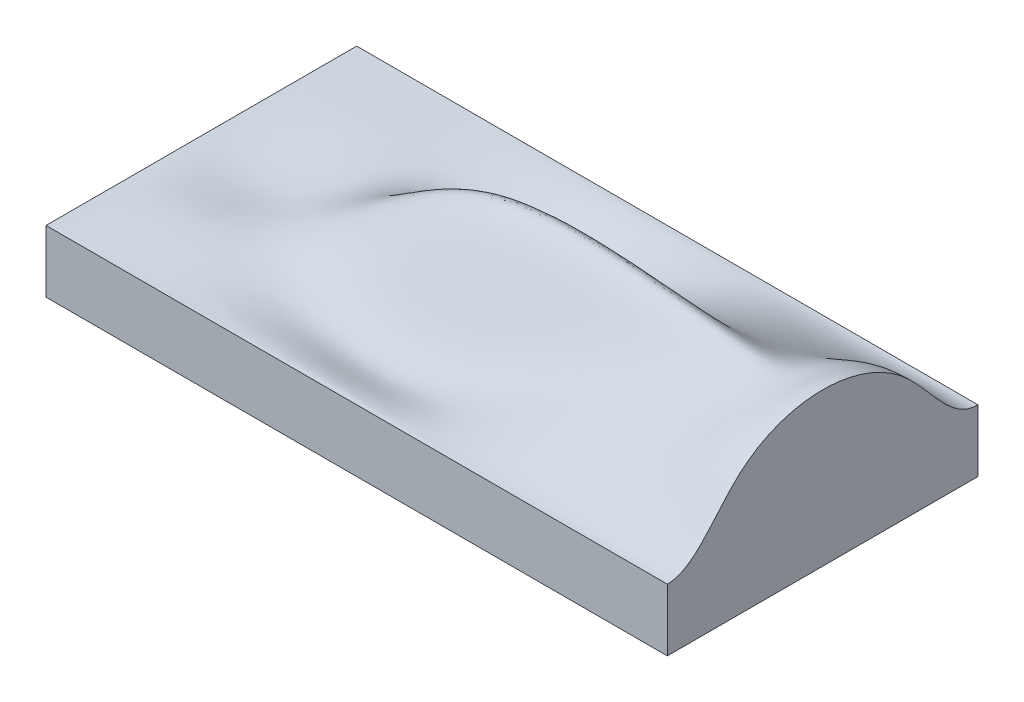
ISO-10303-21;
HEADER;
FILE_DESCRIPTION(('STEP AP214'),'2;1');
FILE_NAME('part.step','',(''),(''),'','','');
FILE_SCHEMA(('AUTOMOTIVE_DESIGN { 1 0 10303 214 1 1 1 1 }'));
ENDSEC;
DATA;
#1=APPLICATION_CONTEXT('core data for automotive mechanical design processes');
#2=APPLICATION_PROTOCOL_DEFINITION('international standard','automotive_design',2000,#1);
#3=PRODUCT_CONTEXT('',#1,'mechanical');
#4=PRODUCT('Part','Part','',(#3));
#5=PRODUCT_RELATED_PRODUCT_CATEGORY('part','',(#4));
#6=PRODUCT_DEFINITION_FORMATION('','',#4);
#7=PRODUCT_DEFINITION_CONTEXT('part definition',#1,'design');
#8=PRODUCT_DEFINITION('design','',#6,#7);
#9=PRODUCT_DEFINITION_SHAPE('','',#8);
#10=(LENGTH_UNIT() NAMED_UNIT(*) SI_UNIT(.MILLI.,.METRE.));
#11=(NAMED_UNIT(*) PLANE_ANGLE_UNIT() SI_UNIT($,.RADIAN.));
#12=(NAMED_UNIT(*) SI_UNIT($,.STERADIAN.) SOLID_ANGLE_UNIT());
#13=UNCERTAINTY_MEASURE_WITH_UNIT(LENGTH_MEASURE(1.E-05),#10,'distance_accuracy_value','');
#14=(GEOMETRIC_REPRESENTATION_CONTEXT(3) GLOBAL_UNCERTAINTY_ASSIGNED_CONTEXT((#13)) GLOBAL_UNIT_ASSIGNED_CONTEXT((#10,
#11,#12)) REPRESENTATION_CONTEXT('',''));
#15=CARTESIAN_POINT('',(0.,0.,0.));
#16=DIRECTION('',(0.,0.,1.));
#17=DIRECTION('',(1.,0.,0.));
#18=AXIS2_PLACEMENT_3D('',#15,#16,#17);
#19=CARTESIAN_POINT('',(127.,25.4,63.5));
#20=DIRECTION('',(-1.,0.,0.));
#21=DIRECTION('',(0.,0.,1.));
#22=AXIS2_PLACEMENT_3D('',#19,#20,#21);
#23=PLANE('',#22);
#24=DIRECTION('',(0.,0.,-1.));
#25=VECTOR('',#24,1.);
#26=CARTESIAN_POINT('',(127.,0.,63.5));
#27=LINE('',#26,#25);
#28=CARTESIAN_POINT('',(127.,0.,63.5));
#29=VERTEX_POINT('',#28);
#30=CARTESIAN_POINT('',(127.,0.,-63.5));
#31=VERTEX_POINT('',#30);
#32=EDGE_CURVE('E129',#29,#31,#27,.T.);
#33=ORIENTED_EDGE('',*,*,#32,.T.);
#34=DIRECTION('',(0.,-1.,0.));
#35=VECTOR('',#34,1.);
#36=CARTESIAN_POINT('',(127.,25.4,-63.5));
#37=LINE('',#36,#35);
#38=CARTESIAN_POINT('',(127.,25.4,-63.5));
#39=VERTEX_POINT('',#38);
#40=EDGE_CURVE('E13',#39,#31,#37,.T.);
#41=ORIENTED_EDGE('',*,*,#40,.F.);
#42=CARTESIAN_POINT('',(127.,25.4,63.5));
#43=CARTESIAN_POINT('',(127.,25.399972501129,63.2735251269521));
#44=CARTESIAN_POINT('',(127.,25.4058899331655,63.047049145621));
#45=CARTESIAN_POINT('',(127.,25.4295775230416,62.5948776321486));
#46=CARTESIAN_POINT('',(127.,25.4473393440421,62.3691816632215));
#47=CARTESIAN_POINT('',(127.,25.4946720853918,61.919094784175));
#48=CARTESIAN_POINT('',(127.,25.5242397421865,61.6947035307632));
#49=CARTESIAN_POINT('',(127.,25.5944910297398,61.2507316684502));
#50=CARTESIAN_POINT('',(127.,25.635021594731,61.0311267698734));
#51=CARTESIAN_POINT('',(127.,25.7270346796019,60.5941898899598));
#52=CARTESIAN_POINT('',(127.,25.7785189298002,60.3768582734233));
#53=CARTESIAN_POINT('',(127.,25.891984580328,59.9449383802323));
#54=CARTESIAN_POINT('',(127.,25.9539672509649,59.7303504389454));
#55=CARTESIAN_POINT('',(127.,26.1173998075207,59.2104394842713));
#56=CARTESIAN_POINT('',(127.,26.2242073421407,58.9067897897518));
#57=CARTESIAN_POINT('',(127.,26.4566946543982,58.3067042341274));
#58=CARTESIAN_POINT('',(127.,26.5823827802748,58.0102716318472));
#59=CARTESIAN_POINT('',(127.,26.8506623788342,57.4251236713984));
#60=CARTESIAN_POINT('',(127.,26.9932568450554,57.1364096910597));
#61=CARTESIAN_POINT('',(127.,27.2942219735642,56.5652930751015));
#62=CARTESIAN_POINT('',(127.,27.4526764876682,56.2829348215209));
#63=CARTESIAN_POINT('',(127.,27.782757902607,55.7261814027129));
#64=CARTESIAN_POINT('',(127.,27.9543804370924,55.4517836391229));
#65=CARTESIAN_POINT('',(127.,28.309021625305,54.9107093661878));
#66=CARTESIAN_POINT('',(127.,28.4920337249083,54.6440285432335));
#67=CARTESIAN_POINT('',(127.,28.9274183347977,54.0346315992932));
#68=CARTESIAN_POINT('',(127.,29.1834330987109,53.6945195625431));
#69=CARTESIAN_POINT('',(127.,29.7096846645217,53.0254345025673));
#70=CARTESIAN_POINT('',(127.,29.9799245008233,52.6964638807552));
#71=CARTESIAN_POINT('',(127.,30.5324386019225,52.0480166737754));
#72=CARTESIAN_POINT('',(127.,30.8147294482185,51.7285542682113));
#73=CARTESIAN_POINT('',(127.,31.38883998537,51.0983793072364));
#74=CARTESIAN_POINT('',(127.,31.6806590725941,50.7876661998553));
#75=CARTESIAN_POINT('',(127.,32.2731480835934,50.1726367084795));
#76=CARTESIAN_POINT('',(127.,32.5738463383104,49.8683477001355));
#77=CARTESIAN_POINT('',(127.,33.1815773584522,49.2661721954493));
#78=CARTESIAN_POINT('',(127.,33.4886102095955,48.9682857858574));
#79=CARTESIAN_POINT('',(127.,34.1085532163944,48.3770498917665));
#80=CARTESIAN_POINT('',(127.,34.4214767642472,48.0837144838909));
#81=CARTESIAN_POINT('',(127.,35.051323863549,47.5013640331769));
#82=CARTESIAN_POINT('',(127.,35.3682475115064,47.212349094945));
#83=CARTESIAN_POINT('',(127.,36.3236798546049,46.350227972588));
#84=CARTESIAN_POINT('',(127.,36.966726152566,45.782162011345));
#85=CARTESIAN_POINT('',(127.,38.2645719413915,44.6472145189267));
#86=CARTESIAN_POINT('',(127.,38.9194250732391,44.0803949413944));
#87=CARTESIAN_POINT('',(127.,40.2277360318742,42.9484803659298));
#88=CARTESIAN_POINT('',(127.,40.8811932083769,42.3833846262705));
#89=CARTESIAN_POINT('',(127.,42.1821140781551,41.2487536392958));
#90=CARTESIAN_POINT('',(127.,42.829586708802,40.6792286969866));
#91=CARTESIAN_POINT('',(127.,44.1141664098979,39.5298233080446));
#92=CARTESIAN_POINT('',(127.,44.7512831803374,38.9499537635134));
#93=CARTESIAN_POINT('',(127.,46.0107347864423,37.7738804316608));
#94=CARTESIAN_POINT('',(127.,46.6330648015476,37.1776714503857));
#95=CARTESIAN_POINT('',(127.,47.7542748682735,36.0656675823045));
#96=CARTESIAN_POINT('',(127.,48.2563707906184,35.5531331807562));
#97=CARTESIAN_POINT('',(127.,48.9957918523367,34.7710349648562));
#98=CARTESIAN_POINT('',(127.,49.240061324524,34.5080252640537));
#99=CARTESIAN_POINT('',(127.,49.7234210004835,33.9772798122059));
#100=CARTESIAN_POINT('',(127.,49.962511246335,33.7095440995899));
#101=CARTESIAN_POINT('',(127.,50.3168255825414,33.3041598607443));
#102=CARTESIAN_POINT('',(127.,50.4342131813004,33.168398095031));
#103=CARTESIAN_POINT('',(127.,50.6674647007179,32.8955720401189));
#104=CARTESIAN_POINT('',(127.,50.7833286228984,32.7585077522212));
#105=CARTESIAN_POINT('',(127.,51.1285997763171,32.3453747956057));
#106=CARTESIAN_POINT('',(127.,51.355688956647,32.0673631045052));
#107=CARTESIAN_POINT('',(127.,51.8035722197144,31.5063336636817));
#108=CARTESIAN_POINT('',(127.,52.0243665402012,31.2233161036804));
#109=CARTESIAN_POINT('',(127.,52.4595685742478,30.6524189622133));
#110=CARTESIAN_POINT('',(127.,52.6739762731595,30.3645393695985));
#111=CARTESIAN_POINT('',(127.,53.3063341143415,29.4954163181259));
#112=CARTESIAN_POINT('',(127.,53.7146646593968,28.9071276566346));
#113=CARTESIAN_POINT('',(127.,54.5050384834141,27.7128907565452));
#114=CARTESIAN_POINT('',(127.,54.8870725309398,27.1069364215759));
#115=CARTESIAN_POINT('',(127.,55.6242446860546,25.8787095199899));
#116=CARTESIAN_POINT('',(127.,55.9793774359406,25.2564337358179));
#117=CARTESIAN_POINT('',(127.,56.6621919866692,23.9970196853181));
#118=CARTESIAN_POINT('',(127.,56.9898736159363,23.3598813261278));
#119=CARTESIAN_POINT('',(127.,57.7225355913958,21.8563097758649));
#120=CARTESIAN_POINT('',(127.,58.1166454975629,20.9845537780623));
#121=CARTESIAN_POINT('',(127.,58.8544822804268,19.2202273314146));
#122=CARTESIAN_POINT('',(127.,59.1982192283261,18.3276610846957));
#123=CARTESIAN_POINT('',(127.,59.8349040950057,16.5246517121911));
#124=CARTESIAN_POINT('',(127.,60.1278547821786,15.6142095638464));
#125=CARTESIAN_POINT('',(127.,60.6630536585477,13.7770163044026));
#126=CARTESIAN_POINT('',(127.,60.9052219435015,12.8502419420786));
#127=CARTESIAN_POINT('',(127.,61.3380639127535,10.9846698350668));
#128=CARTESIAN_POINT('',(127.,61.5287339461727,10.0458712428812));
#129=CARTESIAN_POINT('',(127.,61.8584107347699,8.15928099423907));
#130=CARTESIAN_POINT('',(127.,61.9974160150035,7.21148908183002));
#131=CARTESIAN_POINT('',(127.,62.2810394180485,4.82745599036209));
#132=CARTESIAN_POINT('',(127.,62.3927790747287,3.38717558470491));
#133=CARTESIAN_POINT('',(127.,62.4985399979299,0.502467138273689));
#134=CARTESIAN_POINT('',(127.,62.492563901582,-0.941960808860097));
#135=CARTESIAN_POINT('',(127.,62.3629280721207,-3.82566767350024));
#136=CARTESIAN_POINT('',(127.,62.2392603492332,-5.26494623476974));
#137=CARTESIAN_POINT('',(127.,61.8743571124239,-8.12855386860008));
#138=CARTESIAN_POINT('',(127.,61.6331207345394,-9.55288283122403));
#139=CARTESIAN_POINT('',(127.,61.0238442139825,-12.4219704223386));
#140=CARTESIAN_POINT('',(127.,60.6519856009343,-13.8659193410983));
#141=CARTESIAN_POINT('',(127.,59.7841183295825,-16.7164936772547));
#142=CARTESIAN_POINT('',(127.,59.2880952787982,-18.1231147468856));
#143=CARTESIAN_POINT('',(127.,58.4528582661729,-20.1945844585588));
#144=CARTESIAN_POINT('',(127.,58.1594678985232,-20.8782280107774));
#145=CARTESIAN_POINT('',(127.,57.5424999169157,-22.2317296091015));
#146=CARTESIAN_POINT('',(127.,57.218925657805,-22.9015891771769));
#147=CARTESIAN_POINT('',(127.,56.5420671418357,-24.2258406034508));
#148=CARTESIAN_POINT('',(127.,56.188792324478,-24.8802372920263));
#149=CARTESIAN_POINT('',(127.,55.4529420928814,-26.1722473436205));
#150=CARTESIAN_POINT('',(127.,55.0703711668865,-26.8098632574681));
#151=CARTESIAN_POINT('',(127.,54.4241131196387,-27.8331391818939));
#152=CARTESIAN_POINT('',(127.,54.1691212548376,-28.2243200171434));
#153=CARTESIAN_POINT('',(127.,53.648003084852,-28.9990818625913));
#154=CARTESIAN_POINT('',(127.,53.3818792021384,-29.3826644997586));
#155=CARTESIAN_POINT('',(127.,52.8386498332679,-30.1419229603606));
#156=CARTESIAN_POINT('',(127.,52.5615452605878,-30.5175994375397));
#157=CARTESIAN_POINT('',(127.,51.9970504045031,-31.2600657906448));
#158=CARTESIAN_POINT('',(127.,51.7096797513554,-31.6268705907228));
#159=CARTESIAN_POINT('',(127.,51.1243516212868,-32.3519641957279));
#160=CARTESIAN_POINT('',(127.,50.8263936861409,-32.7102526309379));
#161=CARTESIAN_POINT('',(127.,50.2202545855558,-33.4180254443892));
#162=CARTESIAN_POINT('',(127.,49.9120739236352,-33.7675102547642));
#163=CARTESIAN_POINT('',(127.,48.9757070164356,-34.8022840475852));
#164=CARTESIAN_POINT('',(127.,48.3342891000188,-35.4756169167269));
#165=CARTESIAN_POINT('',(127.,47.0250117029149,-36.7964503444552));
#166=CARTESIAN_POINT('',(127.,46.3571391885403,-37.4439378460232));
#167=CARTESIAN_POINT('',(127.,45.0026952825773,-38.719335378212));
#168=CARTESIAN_POINT('',(127.,44.3161185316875,-39.347239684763));
#169=CARTESIAN_POINT('',(127.,42.9277234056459,-40.5929400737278));
#170=CARTESIAN_POINT('',(127.,42.2258459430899,-41.2106698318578));
#171=CARTESIAN_POINT('',(127.,40.8168022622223,-42.4394859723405));
#172=CARTESIAN_POINT('',(127.,40.1096381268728,-43.0505747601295));
#173=CARTESIAN_POINT('',(127.,38.6962336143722,-44.2735964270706));
#174=CARTESIAN_POINT('',(127.,37.9899931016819,-44.8855291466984));
#175=CARTESIAN_POINT('',(127.,36.9017242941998,-45.8408049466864));
#176=CARTESIAN_POINT('',(127.,36.5169332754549,-46.1809891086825));
#177=CARTESIAN_POINT('',(127.,35.7510855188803,-46.8656142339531));
#178=CARTESIAN_POINT('',(127.,35.3700291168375,-47.2100555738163));
#179=CARTESIAN_POINT('',(127.,34.6131346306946,-47.9048567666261));
#180=CARTESIAN_POINT('',(127.,34.2372980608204,-48.2552182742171));
#181=CARTESIAN_POINT('',(127.,33.4925333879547,-48.9637493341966));
#182=CARTESIAN_POINT('',(127.,33.1236102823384,-49.3219241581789));
#183=CARTESIAN_POINT('',(127.,32.3966369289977,-50.0462639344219));
#184=CARTESIAN_POINT('',(127.,32.0385486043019,-50.4123905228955));
#185=CARTESIAN_POINT('',(127.,31.3344076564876,-51.1560105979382));
#186=CARTESIAN_POINT('',(127.,30.9883535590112,-51.5335026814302));
#187=CARTESIAN_POINT('',(127.,30.3118565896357,-52.3016937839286));
#188=CARTESIAN_POINT('',(127.,29.9814002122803,-52.6923808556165));
#189=CARTESIAN_POINT('',(127.,29.3400705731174,-53.4892410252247));
#190=CARTESIAN_POINT('',(127.,29.0291847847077,-53.8954039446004));
#191=CARTESIAN_POINT('',(127.,28.5552178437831,-54.5541054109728));
#192=CARTESIAN_POINT('',(127.,28.3840897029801,-54.8008640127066));
#193=CARTESIAN_POINT('',(127.,28.0515019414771,-55.300858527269));
#194=CARTESIAN_POINT('',(127.,27.8900428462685,-55.5540947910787));
#195=CARTESIAN_POINT('',(127.,27.5781323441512,-56.0673217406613));
#196=CARTESIAN_POINT('',(127.,27.4276823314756,-56.3273132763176));
#197=CARTESIAN_POINT('',(127.,27.1399333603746,-56.8529701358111));
#198=CARTESIAN_POINT('',(127.,27.0025779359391,-57.1186044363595));
#199=CARTESIAN_POINT('',(127.,26.7417984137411,-57.6566321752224));
#200=CARTESIAN_POINT('',(127.,26.6183736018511,-57.9290252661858));
#201=CARTESIAN_POINT('',(127.,26.3870432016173,-58.4803012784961));
#202=CARTESIAN_POINT('',(127.,26.2791348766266,-58.7591830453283));
#203=CARTESIAN_POINT('',(127.,26.0963084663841,-59.2777098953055));
#204=CARTESIAN_POINT('',(127.,26.0188751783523,-59.5164688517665));
#205=CARTESIAN_POINT('',(127.,25.8768493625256,-59.997771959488));
#206=CARTESIAN_POINT('',(127.,25.8122558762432,-60.240315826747));
#207=CARTESIAN_POINT('',(127.,25.6966369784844,-60.7285718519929));
#208=CARTESIAN_POINT('',(127.,25.6456088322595,-60.9742833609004));
#209=CARTESIAN_POINT('',(127.,25.557040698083,-61.4716785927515));
#210=CARTESIAN_POINT('',(127.,25.5196992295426,-61.7233977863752));
#211=CARTESIAN_POINT('',(127.,25.4598879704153,-62.2286935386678));
#212=CARTESIAN_POINT('',(127.,25.4374237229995,-62.4822707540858));
#213=CARTESIAN_POINT('',(127.,25.4074501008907,-62.990564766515));
#214=CARTESIAN_POINT('',(127.,25.3999558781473,-63.2452824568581));
#215=CARTESIAN_POINT('',(127.,25.4,-63.5));
#216=B_SPLINE_CURVE_WITH_KNOTS('',3,(#42,#43,#44,#45,#46,#47,#48,#49,#50,#51,#52,#53,#54,#55,
#56,#57,#58,#59,#60,#61,#62,#63,#64,#65,#66,#67,#68,#69,#70,#71,#72,#73,#74,#75,#76,#77,#78,#79,
#80,#81,#82,#83,#84,#85,#86,#87,#88,#89,#90,#91,#92,#93,#94,#95,#96,#97,#98,#99,#100,#101,#102,
#103,#104,#105,#106,#107,#108,#109,#110,#111,#112,#113,#114,#115,#116,#117,#118,#119,#120,#121,
#122,#123,#124,#125,#126,#127,#128,#129,#130,#131,#132,#133,#134,#135,#136,#137,#138,#139,#140,
#141,#142,#143,#144,#145,#146,#147,#148,#149,#150,#151,#152,#153,#154,#155,#156,#157,#158,#159,
#160,#161,#162,#163,#164,#165,#166,#167,#168,#169,#170,#171,#172,#173,#174,#175,#176,#177,#178,
#179,#180,#181,#182,#183,#184,#185,#186,#187,#188,#189,#190,#191,#192,#193,#194,#195,#196,#197,
#198,#199,#200,#201,#202,#203,#204,#205,#206,#207,#208,#209,#210,#211,#212,#213,#214,#215),
.UNSPECIFIED.,.F.,.F.,(4,2,2,2,2,2,2,2,2,2,2,2,2,2,2,2,2,2,2,2,2,2,2,2,2,2,2,2,2,2,2,2,2,2,2,2,
2,2,2,2,2,2,2,2,2,2,2,2,2,2,2,2,2,2,2,2,2,2,2,2,2,2,2,2,2,2,2,2,2,2,2,2,2,2,2,2,2,2,2,2,2,2,2,2,
2,2,4),(0.,0.679347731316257,1.35821779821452,2.03690033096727,2.70655677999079,
3.37631909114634,4.04616250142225,5.01109523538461,5.97645588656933,6.94198772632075,
7.91292497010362,8.88354164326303,9.85360484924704,11.1302243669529,12.4071173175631,
13.6858277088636,14.9644572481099,16.2477372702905,17.5310346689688,18.8177248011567,
20.1044460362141,22.6783984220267,25.2766813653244,27.8684059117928,30.455273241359,
33.0395588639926,35.6246757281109,37.776732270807,38.8535130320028,39.9302850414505,
40.4686990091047,41.0071124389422,42.0839276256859,43.1607020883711,44.2374790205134,
46.3850471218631,48.5333653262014,50.6821102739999,52.8308686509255,55.6993317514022,
58.567220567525,61.4349530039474,64.3071644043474,67.1795793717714,70.0520763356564,
74.3807808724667,78.7093884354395,83.0382898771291,87.3672231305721,91.834984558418,
96.3032641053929,98.5344774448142,100.765443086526,102.995702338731,105.225620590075,
106.626300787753,108.026677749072,109.426938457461,110.824651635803,112.222425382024,
113.620130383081,116.408872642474,119.199006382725,121.989948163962,124.794859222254,
127.598717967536,130.402104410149,131.942895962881,133.483824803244,135.025191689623,
136.567632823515,138.103808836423,139.63979597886,141.174427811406,142.7080671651,
143.608752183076,144.509486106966,145.410333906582,146.30710246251,147.203825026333,
148.100389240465,148.853062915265,149.605680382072,150.358146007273,151.121130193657,
151.884398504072,152.648438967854),.UNSPECIFIED.);
#217=CARTESIAN_POINT('',(127.,25.4,63.5));
#218=VERTEX_POINT('',#217);
#219=EDGE_CURVE('E139',#218,#39,#216,.T.);
#220=ORIENTED_EDGE('',*,*,#219,.F.);
#221=DIRECTION('',(0.,-1.,0.));
#222=VECTOR('',#221,1.);
#223=CARTESIAN_POINT('',(127.,25.4,63.5));
#224=LINE('',#223,#222);
#225=EDGE_CURVE('E135',#218,#29,#224,.T.);
#226=ORIENTED_EDGE('',*,*,#225,.T.);
#227=EDGE_LOOP('',(#33,#41,#220,#226));
#228=FACE_BOUND('',#227,.T.);
#229=ADVANCED_FACE('F68',(#228),#23,.F.);
#230=CARTESIAN_POINT('',(-127.,25.4,-63.5));
#231=DIRECTION('',(0.,0.,1.));
#232=DIRECTION('',(1.,0.,0.));
#233=AXIS2_PLACEMENT_3D('',#230,#231,#232);
#234=PLANE('',#233);
#235=DIRECTION('',(-1.,0.,0.));
#236=VECTOR('',#235,1.);
#237=CARTESIAN_POINT('',(-127.,0.,-63.5));
#238=LINE('',#237,#236);
#239=CARTESIAN_POINT('',(-127.,0.,-63.5));
#240=VERTEX_POINT('',#239);
#241=EDGE_CURVE('E126',#31,#240,#238,.T.);
#242=ORIENTED_EDGE('',*,*,#241,.T.);
#243=DIRECTION('',(0.,-1.,0.));
#244=VECTOR('',#243,1.);
#245=CARTESIAN_POINT('',(-127.,25.4,-63.5));
#246=LINE('',#245,#244);
#247=CARTESIAN_POINT('',(-127.,25.4,-63.5));
#248=VERTEX_POINT('',#247);
#249=EDGE_CURVE('E81',#248,#240,#246,.T.);
#250=ORIENTED_EDGE('',*,*,#249,.F.);
#251=DIRECTION('',(-1.,0.,0.));
#252=VECTOR('',#251,1.);
#253=CARTESIAN_POINT('',(-127.,25.4,-63.5));
#254=LINE('',#253,#252);
#255=EDGE_CURVE('E100',#39,#248,#254,.T.);
#256=ORIENTED_EDGE('',*,*,#255,.F.);
#257=ORIENTED_EDGE('',*,*,#40,.T.);
#258=EDGE_LOOP('',(#242,#250,#256,#257));
#259=FACE_BOUND('',#258,.T.);
#260=ADVANCED_FACE('F132',(#259),#234,.F.);
#261=CARTESIAN_POINT('',(-127.,25.4,63.5));
#262=DIRECTION('',(1.,0.,0.));
#263=DIRECTION('',(0.,0.,-1.));
#264=AXIS2_PLACEMENT_3D('',#261,#262,#263);
#265=PLANE('',#264);
#266=DIRECTION('',(0.,0.,1.));
#267=VECTOR('',#266,1.);
#268=CARTESIAN_POINT('',(-127.,0.,63.5));
#269=LINE('',#268,#267);
#270=CARTESIAN_POINT('',(-127.,0.,63.5));
#271=VERTEX_POINT('',#270);
#272=EDGE_CURVE('E118',#240,#271,#269,.T.);
#273=ORIENTED_EDGE('',*,*,#272,.T.);
#274=DIRECTION('',(0.,-1.,0.));
#275=VECTOR('',#274,1.);
#276=CARTESIAN_POINT('',(-127.,25.4,63.5));
#277=LINE('',#276,#275);
#278=CARTESIAN_POINT('',(-127.,25.4,63.5));
#279=VERTEX_POINT('',#278);
#280=EDGE_CURVE('E175',#279,#271,#277,.T.);
#281=ORIENTED_EDGE('',*,*,#280,.F.);
#282=DIRECTION('',(0.,0.,1.));
#283=VECTOR('',#282,1.);
#284=CARTESIAN_POINT('',(-127.,25.4,63.5));
#285=LINE('',#284,#283);
#286=EDGE_CURVE('E179',#248,#279,#285,.T.);
#287=ORIENTED_EDGE('',*,*,#286,.F.);
#288=ORIENTED_EDGE('',*,*,#249,.T.);
#289=EDGE_LOOP('',(#273,#281,#287,#288));
#290=FACE_BOUND('',#289,.T.);
#291=ADVANCED_FACE('F162',(#290),#265,.F.);
#292=CARTESIAN_POINT('',(-127.,25.4,63.5));
#293=DIRECTION('',(0.,0.,-1.));
#294=DIRECTION('',(-1.,0.,0.));
#295=AXIS2_PLACEMENT_3D('',#292,#293,#294);
#296=PLANE('',#295);
#297=DIRECTION('',(1.,0.,0.));
#298=VECTOR('',#297,1.);
#299=CARTESIAN_POINT('',(-127.,0.,63.5));
#300=LINE('',#299,#298);
#301=EDGE_CURVE('E110',#271,#29,#300,.T.);
#302=ORIENTED_EDGE('',*,*,#301,.T.);
#303=ORIENTED_EDGE('',*,*,#225,.F.);
#304=DIRECTION('',(1.,0.,0.));
#305=VECTOR('',#304,1.);
#306=CARTESIAN_POINT('',(-127.,25.4,63.5));
#307=LINE('',#306,#305);
#308=EDGE_CURVE('E90',#279,#218,#307,.T.);
#309=ORIENTED_EDGE('',*,*,#308,.F.);
#310=ORIENTED_EDGE('',*,*,#280,.T.);
#311=EDGE_LOOP('',(#302,#303,#309,#310));
#312=FACE_BOUND('',#311,.T.);
#313=ADVANCED_FACE('F220',(#312),#296,.F.);
#314=CARTESIAN_POINT('',(-127.,25.4,63.5));
#315=CARTESIAN_POINT('',(-111.121460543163,25.4,63.5));
#316=CARTESIAN_POINT('',(-83.0293436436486,25.4,63.5));
#317=CARTESIAN_POINT('',(-42.9608228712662,25.4,63.5));
#318=CARTESIAN_POINT('',(6.68031984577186,25.4,63.5));
#319=CARTESIAN_POINT('',(44.1694861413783,25.4,63.5));
#320=CARTESIAN_POINT('',(78.1304184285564,25.4,63.5));
#321=CARTESIAN_POINT('',(94.0862388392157,25.4,63.5));
#322=CARTESIAN_POINT('',(113.171622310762,25.4,63.5));
#323=CARTESIAN_POINT('',(123.808835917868,25.4,63.5));
#324=CARTESIAN_POINT('',(127.,25.4,63.5));
#325=CARTESIAN_POINT('',(-127.,25.4,51.8601774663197));
#326=CARTESIAN_POINT('',(-111.06271922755,25.4788549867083,51.8157853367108));
#327=CARTESIAN_POINT('',(-83.3253140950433,25.158721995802,52.1199550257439));
#328=CARTESIAN_POINT('',(-42.2347880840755,25.9657367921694,51.2168789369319));
#329=CARTESIAN_POINT('',(6.53303512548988,24.9435395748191,51.9116116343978));
#330=CARTESIAN_POINT('',(42.4844832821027,25.9225382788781,53.7778942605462));
#331=CARTESIAN_POINT('',(78.699244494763,25.2236033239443,51.2127920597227));
#332=CARTESIAN_POINT('',(93.2666943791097,24.8950717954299,52.6172609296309));
#333=CARTESIAN_POINT('',(110.361800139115,24.7939643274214,54.7161987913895));
#334=CARTESIAN_POINT('',(123.808835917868,25.4,51.8601774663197));
#335=CARTESIAN_POINT('',(127.,25.4,51.8601774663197));
#336=CARTESIAN_POINT('',(-127.,25.4,30.693510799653));
#337=CARTESIAN_POINT('',(-110.985270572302,27.5940950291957,30.5860442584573));
#338=CARTESIAN_POINT('',(-82.5480757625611,30.7638189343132,30.2230032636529));
#339=CARTESIAN_POINT('',(-44.3369387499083,9.49227272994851,32.017189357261));
#340=CARTESIAN_POINT('',(4.40291480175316,-9.81665693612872,32.6410670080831));
#341=CARTESIAN_POINT('',(61.0966153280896,41.9213147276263,15.7171091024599));
#342=CARTESIAN_POINT('',(99.3104816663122,55.9261476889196,12.722867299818));
#343=CARTESIAN_POINT('',(108.222064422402,57.9481452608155,21.1634247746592));
#344=CARTESIAN_POINT('',(115.61998809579,55.901428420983,34.6375655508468));
#345=CARTESIAN_POINT('',(123.808835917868,53.6979862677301,38.1119659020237));
#346=CARTESIAN_POINT('',(127.,53.6979862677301,38.1119659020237));
#347=CARTESIAN_POINT('',(-127.,25.4,0.));
#348=CARTESIAN_POINT('',(-110.950411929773,19.9502026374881,0.));
#349=CARTESIAN_POINT('',(-82.1982507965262,13.0421205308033,0.));
#350=CARTESIAN_POINT('',(-45.283089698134,62.3834611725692,0.));
#351=CARTESIAN_POINT('',(3.44417507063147,112.11869981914,0.));
#352=CARTESIAN_POINT('',(69.4736963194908,74.1765076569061,-1.43613936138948E-13));
#353=CARTESIAN_POINT('',(108.587334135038,61.2863601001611,0.));
#354=CARTESIAN_POINT('',(114.953283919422,59.3026626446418,0.));
#355=CARTESIAN_POINT('',(117.986630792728,61.6473376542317,0.));
#356=CARTESIAN_POINT('',(123.808835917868,66.4345455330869,0.));
#357=CARTESIAN_POINT('',(127.,66.4345455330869,0.));
#358=CARTESIAN_POINT('',(-127.,25.4,-30.693510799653));
#359=CARTESIAN_POINT('',(-110.985270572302,27.5940950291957,-30.5860442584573));
#360=CARTESIAN_POINT('',(-82.5480757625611,30.7638189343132,-30.2230032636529));
#361=CARTESIAN_POINT('',(-44.3369387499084,9.49227272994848,-32.017189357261));
#362=CARTESIAN_POINT('',(4.40291480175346,-9.81665693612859,-32.6410670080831));
#363=CARTESIAN_POINT('',(61.0966153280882,41.9213147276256,-15.7171091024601));
#364=CARTESIAN_POINT('',(99.3104816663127,55.9261476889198,-12.722867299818));
#365=CARTESIAN_POINT('',(108.222064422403,57.9481452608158,-21.1634247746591));
#366=CARTESIAN_POINT('',(115.61998809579,55.901428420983,-34.6375655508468));
#367=CARTESIAN_POINT('',(123.808835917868,53.6979862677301,-38.1119659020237));
#368=CARTESIAN_POINT('',(127.,53.6979862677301,-38.1119659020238));
#369=CARTESIAN_POINT('',(-127.,25.4,-51.8601774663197));
#370=CARTESIAN_POINT('',(-111.06271922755,25.4788549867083,-51.8157853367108));
#371=CARTESIAN_POINT('',(-83.3253140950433,25.158721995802,-52.1199550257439));
#372=CARTESIAN_POINT('',(-42.2347880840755,25.9657367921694,-51.2168789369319));
#373=CARTESIAN_POINT('',(6.53303512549,24.9435395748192,-51.9116116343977));
#374=CARTESIAN_POINT('',(42.4844832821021,25.9225382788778,-53.7778942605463));
#375=CARTESIAN_POINT('',(78.6992444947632,25.2236033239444,-51.2127920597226));
#376=CARTESIAN_POINT('',(93.26669437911,24.89507179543,-52.6172609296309));
#377=CARTESIAN_POINT('',(110.361800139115,24.7939643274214,-54.7161987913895));
#378=CARTESIAN_POINT('',(123.808835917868,25.4,-51.8601774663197));
#379=CARTESIAN_POINT('',(127.,25.4,-51.8601774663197));
#380=CARTESIAN_POINT('',(-127.,25.4,-63.5));
#381=CARTESIAN_POINT('',(-111.121460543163,25.4,-63.5));
#382=CARTESIAN_POINT('',(-83.0293436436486,25.4,-63.5));
#383=CARTESIAN_POINT('',(-42.9608228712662,25.4,-63.5));
#384=CARTESIAN_POINT('',(6.68031984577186,25.4,-63.5));
#385=CARTESIAN_POINT('',(44.1694861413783,25.4,-63.5));
#386=CARTESIAN_POINT('',(78.1304184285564,25.4,-63.5));
#387=CARTESIAN_POINT('',(94.0862388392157,25.4,-63.5));
#388=CARTESIAN_POINT('',(113.171622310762,25.4,-63.5));
#389=CARTESIAN_POINT('',(123.808835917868,25.4,-63.5));
#390=CARTESIAN_POINT('',(127.,25.4,-63.5));
#391=B_SPLINE_SURFACE_WITH_KNOTS('',3,3,((#314,#315,#316,#317,#318,#319,#320,#321,#322,#323,
#324),(#325,#326,#327,#328,#329,#330,#331,#332,#333,#334,#335),(#336,#337,#338,#339,#340,#341,
#342,#343,#344,#345,#346),(#347,#348,#349,#350,#351,#352,#353,#354,#355,#356,#357),(#358,#359,
#360,#361,#362,#363,#364,#365,#366,#367,#368),(#369,#370,#371,#372,#373,#374,#375,#376,#377,
#378,#379),(#380,#381,#382,#383,#384,#385,#386,#387,#388,#389,#390)),.UNSPECIFIED.,.F.,.F.,.F.,
(4,1,1,1,4),(4,1,1,1,1,1,1,1,4),(0.,0.274956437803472,0.5,0.725043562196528,1.),(0.,
0.187541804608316,0.331796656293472,0.473250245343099,0.773854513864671,0.774582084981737,
0.874363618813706,0.962309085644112,1.),.UNSPECIFIED.);
#392=ORIENTED_EDGE('',*,*,#219,.T.);
#393=ORIENTED_EDGE('',*,*,#255,.T.);
#394=ORIENTED_EDGE('',*,*,#286,.T.);
#395=ORIENTED_EDGE('',*,*,#308,.T.);
#396=EDGE_LOOP('',(#392,#393,#394,#395));
#397=FACE_BOUND('',#396,.T.);
#398=ADVANCED_FACE('F70',(#397),#391,.F.);
#399=CARTESIAN_POINT('',(0.,0.,0.));
#400=DIRECTION('',(0.,-1.,0.));
#401=DIRECTION('',(0.,0.,-1.));
#402=AXIS2_PLACEMENT_3D('',#399,#400,#401);
#403=PLANE('',#402);
#404=ORIENTED_EDGE('',*,*,#32,.F.);
#405=ORIENTED_EDGE('',*,*,#301,.F.);
#406=ORIENTED_EDGE('',*,*,#272,.F.);
#407=ORIENTED_EDGE('',*,*,#241,.F.);
#408=EDGE_LOOP('',(#404,#405,#406,#407));
#409=FACE_BOUND('',#408,.T.);
#410=ADVANCED_FACE('F127',(#409),#403,.T.);
#411=CLOSED_SHELL('',(#229,#260,#291,#313,#398,#410));
#412=MANIFOLD_SOLID_BREP('B2',#411);
#413=ADVANCED_BREP_SHAPE_REPRESENTATION('',(#18,#412),#14);
#414=SHAPE_DEFINITION_REPRESENTATION(#9,#413);
ENDSEC;
END-ISO-10303-21;
